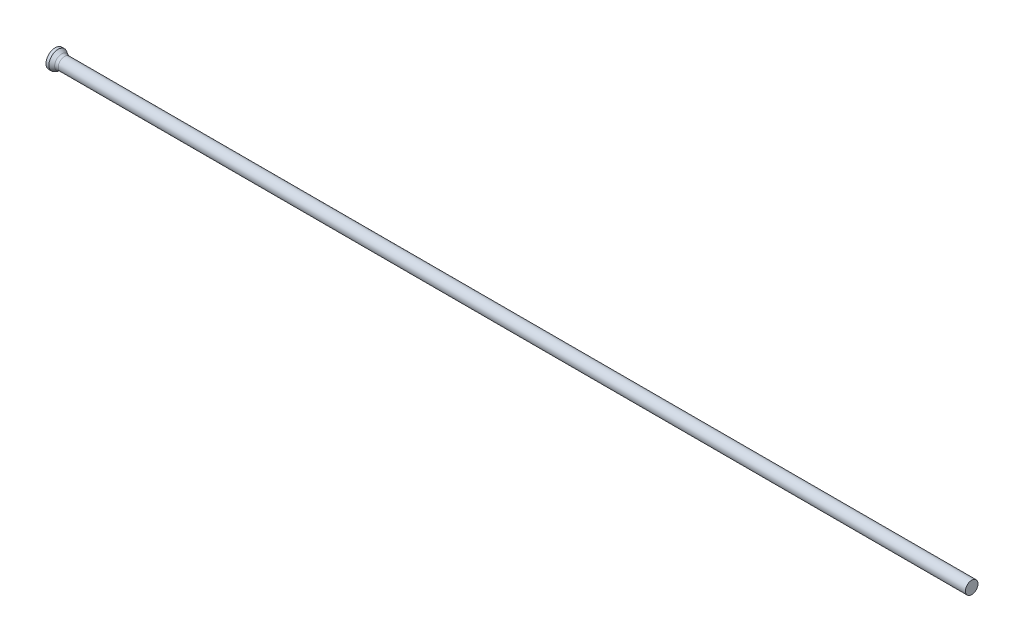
ISO-10303-21;
HEADER;
FILE_DESCRIPTION(('STEP AP214'),'2;1');
FILE_NAME('part.step','',(''),(''),'','','');
FILE_SCHEMA(('AUTOMOTIVE_DESIGN { 1 0 10303 214 1 1 1 1 }'));
ENDSEC;
DATA;
#1=APPLICATION_CONTEXT('core data for automotive mechanical design processes');
#2=APPLICATION_PROTOCOL_DEFINITION('international standard','automotive_design',2000,#1);
#3=PRODUCT_CONTEXT('',#1,'mechanical');
#4=PRODUCT('Part','Part','',(#3));
#5=PRODUCT_RELATED_PRODUCT_CATEGORY('part','',(#4));
#6=PRODUCT_DEFINITION_FORMATION('','',#4);
#7=PRODUCT_DEFINITION_CONTEXT('part definition',#1,'design');
#8=PRODUCT_DEFINITION('design','',#6,#7);
#9=PRODUCT_DEFINITION_SHAPE('','',#8);
#10=(LENGTH_UNIT() NAMED_UNIT(*) SI_UNIT(.MILLI.,.METRE.));
#11=(NAMED_UNIT(*) PLANE_ANGLE_UNIT() SI_UNIT($,.RADIAN.));
#12=(NAMED_UNIT(*) SI_UNIT($,.STERADIAN.) SOLID_ANGLE_UNIT());
#13=UNCERTAINTY_MEASURE_WITH_UNIT(LENGTH_MEASURE(1.E-05),#10,'distance_accuracy_value','');
#14=(GEOMETRIC_REPRESENTATION_CONTEXT(3) GLOBAL_UNCERTAINTY_ASSIGNED_CONTEXT((#13)) GLOBAL_UNIT_ASSIGNED_CONTEXT((#10,
#11,#12)) REPRESENTATION_CONTEXT('',''));
#15=CARTESIAN_POINT('',(0.,0.,0.));
#16=DIRECTION('',(0.,0.,1.));
#17=DIRECTION('',(1.,0.,0.));
#18=AXIS2_PLACEMENT_3D('',#15,#16,#17);
#19=CARTESIAN_POINT('',(0.,0.,0.));
#20=DIRECTION('',(1.,0.,0.));
#21=DIRECTION('',(0.,0.,-1.));
#22=AXIS2_PLACEMENT_3D('',#19,#20,#21);
#23=PLANE('',#22);
#24=CARTESIAN_POINT('',(0.,0.,0.));
#25=DIRECTION('',(-1.,0.,0.));
#26=DIRECTION('',(0.,0.,1.));
#27=AXIS2_PLACEMENT_3D('',#24,#25,#26);
#28=CIRCLE('',#27,1.6);
#29=CARTESIAN_POINT('',(0.,0.,1.6));
#30=VERTEX_POINT('',#29);
#31=EDGE_CURVE('E25',#30,#30,#28,.T.);
#32=ORIENTED_EDGE('',*,*,#31,.T.);
#33=EDGE_LOOP('',(#32));
#34=FACE_BOUND('',#33,.T.);
#35=ADVANCED_FACE('F14',(#34),#23,.F.);
#36=CARTESIAN_POINT('',(0.,0.,0.));
#37=DIRECTION('',(-1.,0.,0.));
#38=DIRECTION('',(0.,0.,1.));
#39=AXIS2_PLACEMENT_3D('',#36,#37,#38);
#40=CYLINDRICAL_SURFACE('',#39,1.6);
#41=ORIENTED_EDGE('',*,*,#31,.F.);
#42=EDGE_LOOP('',(#41));
#43=FACE_BOUND('',#42,.T.);
#44=CARTESIAN_POINT('',(0.503974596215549,0.,0.));
#45=DIRECTION('',(-1.,0.,0.));
#46=DIRECTION('',(0.,0.,1.));
#47=AXIS2_PLACEMENT_3D('',#44,#45,#46);
#48=CIRCLE('',#47,1.6);
#49=CARTESIAN_POINT('',(0.503974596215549,0.,1.6));
#50=VERTEX_POINT('',#49);
#51=EDGE_CURVE('E29',#50,#50,#48,.T.);
#52=ORIENTED_EDGE('',*,*,#51,.T.);
#53=EDGE_LOOP('',(#52));
#54=FACE_BOUND('',#53,.T.);
#55=ADVANCED_FACE('F53',(#43,#54),#40,.T.);
#56=CARTESIAN_POINT('',(1.37,0.,0.));
#57=DIRECTION('',(-1.,0.,0.));
#58=DIRECTION('',(0.,0.,1.));
#59=AXIS2_PLACEMENT_3D('',#56,#57,#58);
#60=CONICAL_SURFACE('',#59,1.1,0.523598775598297);
#61=CARTESIAN_POINT('',(1.13794919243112,0.,0.));
#62=DIRECTION('',(-1.,0.,0.));
#63=DIRECTION('',(0.,0.,1.));
#64=AXIS2_PLACEMENT_3D('',#61,#62,#63);
#65=CIRCLE('',#64,1.23397459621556);
#66=CARTESIAN_POINT('',(1.13794919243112,0.,1.23397459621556));
#67=VERTEX_POINT('',#66);
#68=EDGE_CURVE('E21',#67,#67,#65,.T.);
#69=ORIENTED_EDGE('',*,*,#68,.T.);
#70=EDGE_LOOP('',(#69));
#71=FACE_BOUND('',#70,.T.);
#72=ORIENTED_EDGE('',*,*,#51,.F.);
#73=EDGE_LOOP('',(#72));
#74=FACE_BOUND('',#73,.T.);
#75=ADVANCED_FACE('F50',(#71,#74),#60,.T.);
#76=CARTESIAN_POINT('',(0.,0.,0.));
#77=DIRECTION('',(-1.,0.,0.));
#78=DIRECTION('',(0.,0.,1.));
#79=AXIS2_PLACEMENT_3D('',#76,#77,#78);
#80=CYLINDRICAL_SURFACE('',#79,1.1);
#81=CARTESIAN_POINT('',(1.63794919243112,0.,0.));
#82=DIRECTION('',(-1.,0.,0.));
#83=DIRECTION('',(0.,0.,1.));
#84=AXIS2_PLACEMENT_3D('',#81,#82,#83);
#85=CIRCLE('',#84,1.1);
#86=CARTESIAN_POINT('',(1.63794919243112,0.,1.1));
#87=VERTEX_POINT('',#86);
#88=EDGE_CURVE('E9',#87,#87,#85,.F.);
#89=ORIENTED_EDGE('',*,*,#88,.T.);
#90=EDGE_LOOP('',(#89));
#91=FACE_BOUND('',#90,.T.);
#92=CARTESIAN_POINT('',(160.,0.,0.));
#93=DIRECTION('',(-1.,0.,0.));
#94=DIRECTION('',(0.,0.,1.));
#95=AXIS2_PLACEMENT_3D('',#92,#93,#94);
#96=CIRCLE('',#95,1.1);
#97=CARTESIAN_POINT('',(160.,0.,1.1));
#98=VERTEX_POINT('',#97);
#99=EDGE_CURVE('E34',#98,#98,#96,.T.);
#100=ORIENTED_EDGE('',*,*,#99,.T.);
#101=EDGE_LOOP('',(#100));
#102=FACE_BOUND('',#101,.T.);
#103=ADVANCED_FACE('F38',(#91,#102),#80,.T.);
#104=CARTESIAN_POINT('',(160.,1.1,0.));
#105=DIRECTION('',(-1.,0.,0.));
#106=DIRECTION('',(0.,0.,1.));
#107=AXIS2_PLACEMENT_3D('',#104,#105,#106);
#108=PLANE('',#107);
#109=ORIENTED_EDGE('',*,*,#99,.F.);
#110=EDGE_LOOP('',(#109));
#111=FACE_BOUND('',#110,.T.);
#112=ADVANCED_FACE('F40',(#111),#108,.F.);
#113=CARTESIAN_POINT('',(1.63794919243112,0.,0.));
#114=DIRECTION('',(-1.,0.,0.));
#115=DIRECTION('',(0.,0.,1.));
#116=AXIS2_PLACEMENT_3D('',#113,#114,#115);
#117=TOROIDAL_SURFACE('',#116,2.1,1.);
#118=ORIENTED_EDGE('',*,*,#88,.F.);
#119=EDGE_LOOP('',(#118));
#120=FACE_BOUND('',#119,.T.);
#121=ORIENTED_EDGE('',*,*,#68,.F.);
#122=EDGE_LOOP('',(#121));
#123=FACE_BOUND('',#122,.T.);
#124=ADVANCED_FACE('F16',(#120,#123),#117,.F.);
#125=CLOSED_SHELL('',(#35,#55,#75,#103,#112,#124));
#126=MANIFOLD_SOLID_BREP('B1',#125);
#127=ADVANCED_BREP_SHAPE_REPRESENTATION('',(#18,#126),#14);
#128=SHAPE_DEFINITION_REPRESENTATION(#9,#127);
ENDSEC;
END-ISO-10303-21;
